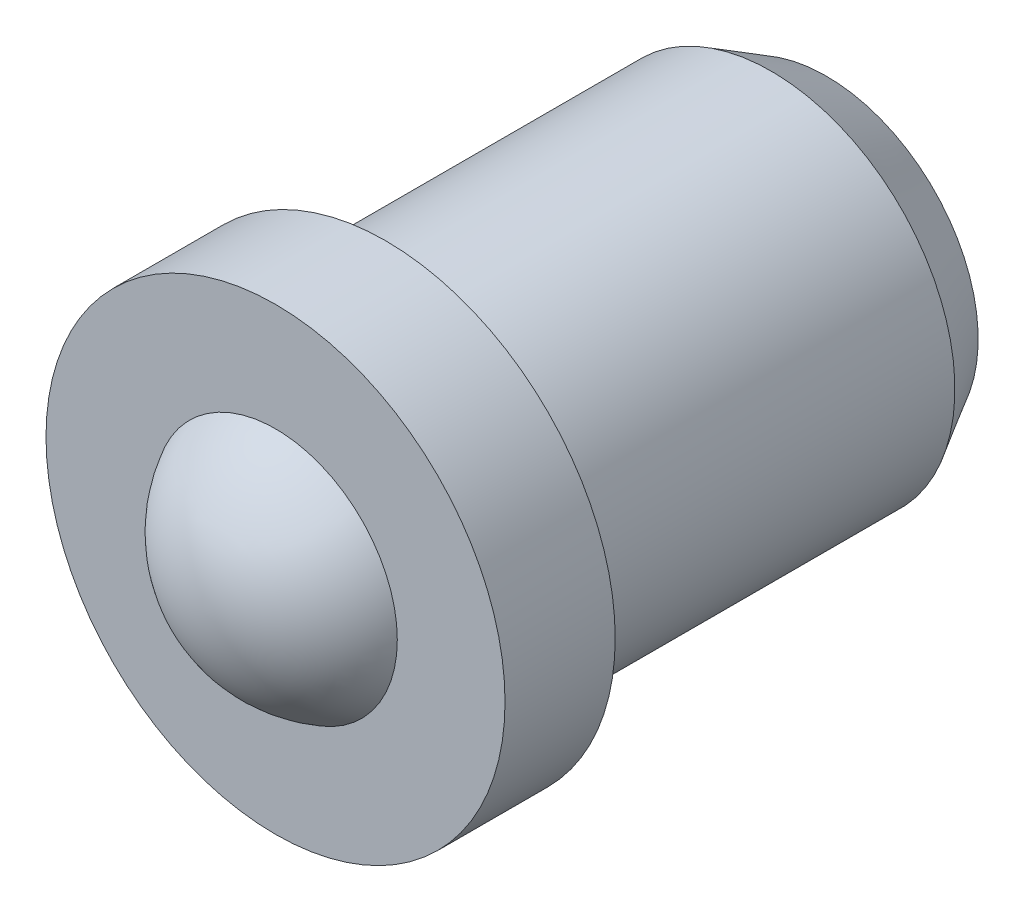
ISO-10303-21;
HEADER;
FILE_DESCRIPTION(('STEP AP214'),'2;1');
FILE_NAME('part.step','',(''),(''),'','','');
FILE_SCHEMA(('AUTOMOTIVE_DESIGN { 1 0 10303 214 1 1 1 1 }'));
ENDSEC;
DATA;
#1=APPLICATION_CONTEXT('core data for automotive mechanical design processes');
#2=APPLICATION_PROTOCOL_DEFINITION('international standard','automotive_design',2000,#1);
#3=PRODUCT_CONTEXT('',#1,'mechanical');
#4=PRODUCT('Part','Part','',(#3));
#5=PRODUCT_RELATED_PRODUCT_CATEGORY('part','',(#4));
#6=PRODUCT_DEFINITION_FORMATION('','',#4);
#7=PRODUCT_DEFINITION_CONTEXT('part definition',#1,'design');
#8=PRODUCT_DEFINITION('design','',#6,#7);
#9=PRODUCT_DEFINITION_SHAPE('','',#8);
#10=(LENGTH_UNIT() NAMED_UNIT(*) SI_UNIT(.MILLI.,.METRE.));
#11=(NAMED_UNIT(*) PLANE_ANGLE_UNIT() SI_UNIT($,.RADIAN.));
#12=(NAMED_UNIT(*) SI_UNIT($,.STERADIAN.) SOLID_ANGLE_UNIT());
#13=UNCERTAINTY_MEASURE_WITH_UNIT(LENGTH_MEASURE(1.E-05),#10,'distance_accuracy_value','');
#14=(GEOMETRIC_REPRESENTATION_CONTEXT(3) GLOBAL_UNCERTAINTY_ASSIGNED_CONTEXT((#13)) GLOBAL_UNIT_ASSIGNED_CONTEXT((#10,
#11,#12)) REPRESENTATION_CONTEXT('',''));
#15=CARTESIAN_POINT('',(0.,0.,0.));
#16=DIRECTION('',(0.,0.,1.));
#17=DIRECTION('',(1.,0.,0.));
#18=AXIS2_PLACEMENT_3D('',#15,#16,#17);
#19=CARTESIAN_POINT('',(0.,0.,-2.4));
#20=DIRECTION('',(0.,0.,1.));
#21=DIRECTION('',(-1.,0.,0.));
#22=AXIS2_PLACEMENT_3D('',#19,#20,#21);
#23=PLANE('',#22);
#24=CARTESIAN_POINT('',(0.,0.,-2.4));
#25=DIRECTION('',(0.,0.,1.));
#26=DIRECTION('',(-1.,0.,0.));
#27=AXIS2_PLACEMENT_3D('',#24,#25,#26);
#28=CIRCLE('',#27,0.826794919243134);
#29=CARTESIAN_POINT('',(-0.826794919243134,0.,-2.4));
#30=VERTEX_POINT('',#29);
#31=EDGE_CURVE('E8',#30,#30,#28,.T.);
#32=ORIENTED_EDGE('',*,*,#31,.F.);
#33=EDGE_LOOP('',(#32));
#34=FACE_BOUND('',#33,.T.);
#35=ADVANCED_FACE('F12',(#34),#23,.F.);
#36=CARTESIAN_POINT('',(0.,0.,-2.4));
#37=DIRECTION('',(0.,0.,1.));
#38=DIRECTION('',(-1.,0.,0.));
#39=AXIS2_PLACEMENT_3D('',#36,#37,#38);
#40=CONICAL_SURFACE('',#39,0.826794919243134,0.523598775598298);
#41=CARTESIAN_POINT('',(0.,0.,-2.1));
#42=DIRECTION('',(0.,0.,1.));
#43=DIRECTION('',(-1.,0.,0.));
#44=AXIS2_PLACEMENT_3D('',#41,#42,#43);
#45=CIRCLE('',#44,1.00000000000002);
#46=CARTESIAN_POINT('',(-1.00000000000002,0.,-2.1));
#47=VERTEX_POINT('',#46);
#48=EDGE_CURVE('E19',#47,#47,#45,.T.);
#49=ORIENTED_EDGE('',*,*,#48,.F.);
#50=EDGE_LOOP('',(#49));
#51=FACE_BOUND('',#50,.T.);
#52=ORIENTED_EDGE('',*,*,#31,.T.);
#53=EDGE_LOOP('',(#52));
#54=FACE_BOUND('',#53,.T.);
#55=ADVANCED_FACE('F54',(#51,#54),#40,.T.);
#56=CARTESIAN_POINT('',(0.,0.,0.6));
#57=DIRECTION('',(0.,0.,1.));
#58=DIRECTION('',(-1.,0.,0.));
#59=AXIS2_PLACEMENT_3D('',#56,#57,#58);
#60=CYLINDRICAL_SURFACE('',#59,1.00000000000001);
#61=CARTESIAN_POINT('',(0.,0.,0.));
#62=DIRECTION('',(0.,0.,1.));
#63=DIRECTION('',(-1.,0.,0.));
#64=AXIS2_PLACEMENT_3D('',#61,#62,#63);
#65=CIRCLE('',#64,1.);
#66=CARTESIAN_POINT('',(-1.,0.,0.));
#67=VERTEX_POINT('',#66);
#68=EDGE_CURVE('E23',#67,#67,#65,.T.);
#69=ORIENTED_EDGE('',*,*,#68,.F.);
#70=EDGE_LOOP('',(#69));
#71=FACE_BOUND('',#70,.T.);
#72=ORIENTED_EDGE('',*,*,#48,.T.);
#73=EDGE_LOOP('',(#72));
#74=FACE_BOUND('',#73,.T.);
#75=ADVANCED_FACE('F59',(#71,#74),#60,.T.);
#76=CARTESIAN_POINT('',(-1.,0.,0.));
#77=DIRECTION('',(0.,0.,1.));
#78=DIRECTION('',(-1.,0.,0.));
#79=AXIS2_PLACEMENT_3D('',#76,#77,#78);
#80=PLANE('',#79);
#81=CARTESIAN_POINT('',(0.,0.,0.));
#82=DIRECTION('',(0.,0.,1.));
#83=DIRECTION('',(-1.,0.,0.));
#84=AXIS2_PLACEMENT_3D('',#81,#82,#83);
#85=CIRCLE('',#84,1.25);
#86=CARTESIAN_POINT('',(-1.25,0.,0.));
#87=VERTEX_POINT('',#86);
#88=EDGE_CURVE('E28',#87,#87,#85,.T.);
#89=ORIENTED_EDGE('',*,*,#88,.F.);
#90=EDGE_LOOP('',(#89));
#91=FACE_BOUND('',#90,.T.);
#92=ORIENTED_EDGE('',*,*,#68,.T.);
#93=EDGE_LOOP('',(#92));
#94=FACE_BOUND('',#93,.T.);
#95=ADVANCED_FACE('F50',(#91,#94),#80,.F.);
#96=CARTESIAN_POINT('',(0.,0.,0.6));
#97=DIRECTION('',(0.,0.,1.));
#98=DIRECTION('',(-1.,0.,0.));
#99=AXIS2_PLACEMENT_3D('',#96,#97,#98);
#100=CYLINDRICAL_SURFACE('',#99,1.25);
#101=CARTESIAN_POINT('',(0.,0.,0.6));
#102=DIRECTION('',(0.,0.,1.));
#103=DIRECTION('',(-1.,0.,0.));
#104=AXIS2_PLACEMENT_3D('',#101,#102,#103);
#105=CIRCLE('',#104,1.25);
#106=CARTESIAN_POINT('',(-1.25,0.,0.6));
#107=VERTEX_POINT('',#106);
#108=EDGE_CURVE('E31',#107,#107,#105,.T.);
#109=ORIENTED_EDGE('',*,*,#108,.F.);
#110=EDGE_LOOP('',(#109));
#111=FACE_BOUND('',#110,.T.);
#112=ORIENTED_EDGE('',*,*,#88,.T.);
#113=EDGE_LOOP('',(#112));
#114=FACE_BOUND('',#113,.T.);
#115=ADVANCED_FACE('F42',(#111,#114),#100,.T.);
#116=CARTESIAN_POINT('',(-1.25,0.,0.6));
#117=DIRECTION('',(0.,0.,-1.));
#118=DIRECTION('',(1.,0.,0.));
#119=AXIS2_PLACEMENT_3D('',#116,#117,#118);
#120=PLANE('',#119);
#121=ORIENTED_EDGE('',*,*,#108,.T.);
#122=EDGE_LOOP('',(#121));
#123=FACE_BOUND('',#122,.T.);
#124=CARTESIAN_POINT('',(0.,0.,0.6));
#125=DIRECTION('',(0.,0.,-1.));
#126=DIRECTION('',(1.,0.,0.));
#127=AXIS2_PLACEMENT_3D('',#124,#125,#126);
#128=CIRCLE('',#127,0.663324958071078);
#129=CARTESIAN_POINT('',(0.663324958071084,0.,0.6));
#130=VERTEX_POINT('',#129);
#131=EDGE_CURVE('E15',#130,#130,#128,.F.);
#132=ORIENTED_EDGE('',*,*,#131,.F.);
#133=EDGE_LOOP('',(#132));
#134=FACE_BOUND('',#133,.T.);
#135=ADVANCED_FACE('F40',(#123,#134),#120,.F.);
#136=CARTESIAN_POINT('',(0.,0.,0.25));
#137=DIRECTION('',(0.,0.,-1.));
#138=DIRECTION('',(-1.,0.,0.));
#139=AXIS2_PLACEMENT_3D('',#136,#137,#138);
#140=SPHERICAL_SURFACE('',#139,0.75);
#141=ORIENTED_EDGE('',*,*,#131,.T.);
#142=EDGE_LOOP('',(#141));
#143=FACE_BOUND('',#142,.T.);
#144=ADVANCED_FACE('F38',(#143),#140,.T.);
#145=CLOSED_SHELL('',(#35,#55,#75,#95,#115,#135,#144));
#146=MANIFOLD_SOLID_BREP('B1',#145);
#147=ADVANCED_BREP_SHAPE_REPRESENTATION('',(#18,#146),#14);
#148=SHAPE_DEFINITION_REPRESENTATION(#9,#147);
ENDSEC;
END-ISO-10303-21;
